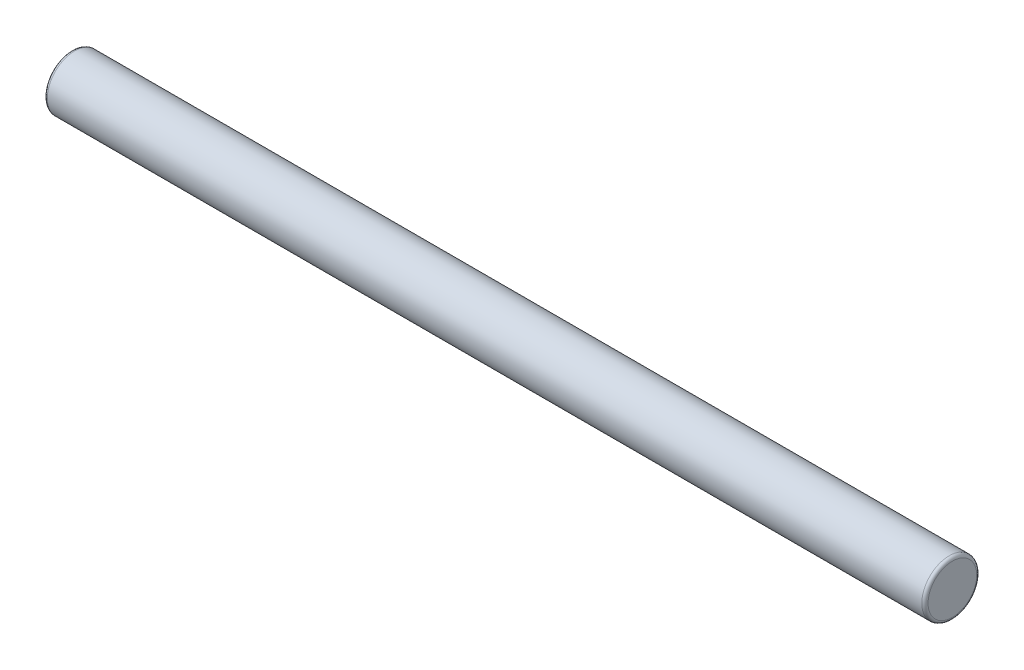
from build123d import *

# Parameters (mm, degrees)
SCHIZZO1_W  = 561
SCHIZZO1_H  = 17.5
RACCORDO1_R = 2


with BuildPart() as part:
    # Schizzo1 → Rivoluzione1 (revolve)
    with BuildSketch(Plane.XY, mode=Mode.PRIVATE) as rivoluzione1_sk:
        with Locations((0, 8.75)):
            Rectangle(SCHIZZO1_W, SCHIZZO1_H)
    revolve(rivoluzione1_sk.sketch.rotate(Axis((-280.5, 0, 0), (1, 0, 0)), 180), axis=Axis((-280.5, 0, 0), (1, 0, 0)))

    # Raccordo1
    raccordo1_edges = [part.edges().sort_by_distance(p)[0] for p in [
        (280.5, 17.5, 0),
        (-280.5, 17.5, 0),
    ]]
    fillet(raccordo1_edges, radius=RACCORDO1_R)


solid = part.part
